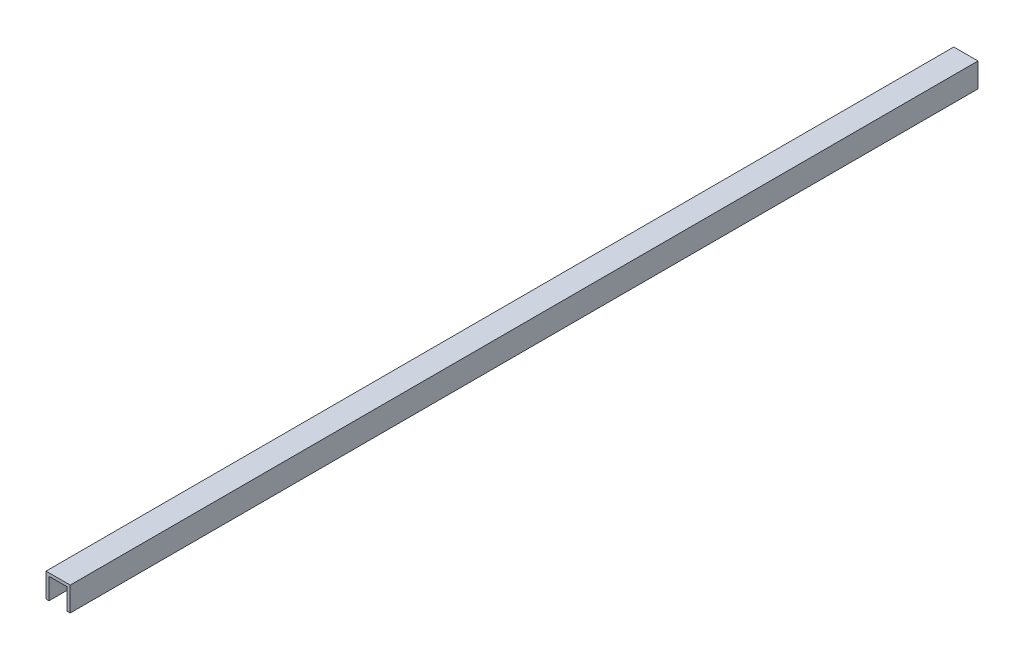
ISO-10303-21;
HEADER;
FILE_DESCRIPTION(('STEP AP214'),'2;1');
FILE_NAME('part.step','',(''),(''),'','','');
FILE_SCHEMA(('AUTOMOTIVE_DESIGN { 1 0 10303 214 1 1 1 1 }'));
ENDSEC;
DATA;
#1=APPLICATION_CONTEXT('core data for automotive mechanical design processes');
#2=APPLICATION_PROTOCOL_DEFINITION('international standard','automotive_design',2000,#1);
#3=PRODUCT_CONTEXT('',#1,'mechanical');
#4=PRODUCT('Part','Part','',(#3));
#5=PRODUCT_RELATED_PRODUCT_CATEGORY('part','',(#4));
#6=PRODUCT_DEFINITION_FORMATION('','',#4);
#7=PRODUCT_DEFINITION_CONTEXT('part definition',#1,'design');
#8=PRODUCT_DEFINITION('design','',#6,#7);
#9=PRODUCT_DEFINITION_SHAPE('','',#8);
#10=(LENGTH_UNIT() NAMED_UNIT(*) SI_UNIT(.MILLI.,.METRE.));
#11=(NAMED_UNIT(*) PLANE_ANGLE_UNIT() SI_UNIT($,.RADIAN.));
#12=(NAMED_UNIT(*) SI_UNIT($,.STERADIAN.) SOLID_ANGLE_UNIT());
#13=UNCERTAINTY_MEASURE_WITH_UNIT(LENGTH_MEASURE(1.E-05),#10,'distance_accuracy_value','');
#14=(GEOMETRIC_REPRESENTATION_CONTEXT(3) GLOBAL_UNCERTAINTY_ASSIGNED_CONTEXT((#13)) GLOBAL_UNIT_ASSIGNED_CONTEXT((#10,
#11,#12)) REPRESENTATION_CONTEXT('',''));
#15=CARTESIAN_POINT('',(0.,0.,0.));
#16=DIRECTION('',(0.,0.,1.));
#17=DIRECTION('',(1.,0.,0.));
#18=AXIS2_PLACEMENT_3D('',#15,#16,#17);
#19=CARTESIAN_POINT('',(4.,-4.,150.));
#20=DIRECTION('',(0.,-1.,0.));
#21=DIRECTION('',(1.,0.,0.));
#22=AXIS2_PLACEMENT_3D('',#19,#20,#21);
#23=PLANE('',#22);
#24=DIRECTION('',(-1.,0.,0.));
#25=VECTOR('',#24,1.);
#26=CARTESIAN_POINT('',(4.,-4.,150.));
#27=LINE('',#26,#25);
#28=CARTESIAN_POINT('',(4.,-4.,150.));
#29=VERTEX_POINT('',#28);
#30=CARTESIAN_POINT('',(3.,-4.,150.));
#31=VERTEX_POINT('',#30);
#32=EDGE_CURVE('E123',#29,#31,#27,.T.);
#33=ORIENTED_EDGE('',*,*,#32,.T.);
#34=DIRECTION('',(0.,0.,-1.));
#35=VECTOR('',#34,1.);
#36=CARTESIAN_POINT('',(3.,-4.,150.));
#37=LINE('',#36,#35);
#38=CARTESIAN_POINT('',(3.,-4.,-150.));
#39=VERTEX_POINT('',#38);
#40=EDGE_CURVE('E112',#31,#39,#37,.T.);
#41=ORIENTED_EDGE('',*,*,#40,.T.);
#42=DIRECTION('',(-1.,0.,0.));
#43=VECTOR('',#42,1.);
#44=CARTESIAN_POINT('',(4.,-4.,-150.));
#45=LINE('',#44,#43);
#46=CARTESIAN_POINT('',(4.,-4.,-150.));
#47=VERTEX_POINT('',#46);
#48=EDGE_CURVE('E121',#47,#39,#45,.T.);
#49=ORIENTED_EDGE('',*,*,#48,.F.);
#50=DIRECTION('',(0.,0.,-1.));
#51=VECTOR('',#50,1.);
#52=CARTESIAN_POINT('',(4.,-4.,150.));
#53=LINE('',#52,#51);
#54=EDGE_CURVE('E59',#29,#47,#53,.T.);
#55=ORIENTED_EDGE('',*,*,#54,.F.);
#56=EDGE_LOOP('',(#33,#41,#49,#55));
#57=FACE_BOUND('',#56,.T.);
#58=ADVANCED_FACE('F35',(#57),#23,.T.);
#59=CARTESIAN_POINT('',(4.,-4.,150.));
#60=DIRECTION('',(-1.,0.,0.));
#61=DIRECTION('',(0.,0.,1.));
#62=AXIS2_PLACEMENT_3D('',#59,#60,#61);
#63=PLANE('',#62);
#64=DIRECTION('',(0.,1.,0.));
#65=VECTOR('',#64,1.);
#66=CARTESIAN_POINT('',(4.,-4.,-150.));
#67=LINE('',#66,#65);
#68=CARTESIAN_POINT('',(4.,4.,-150.));
#69=VERTEX_POINT('',#68);
#70=EDGE_CURVE('E128',#47,#69,#67,.T.);
#71=ORIENTED_EDGE('',*,*,#70,.T.);
#72=DIRECTION('',(0.,0.,-1.));
#73=VECTOR('',#72,1.);
#74=CARTESIAN_POINT('',(4.,4.,150.));
#75=LINE('',#74,#73);
#76=CARTESIAN_POINT('',(4.,4.,150.));
#77=VERTEX_POINT('',#76);
#78=EDGE_CURVE('E11',#77,#69,#75,.T.);
#79=ORIENTED_EDGE('',*,*,#78,.F.);
#80=DIRECTION('',(0.,1.,0.));
#81=VECTOR('',#80,1.);
#82=CARTESIAN_POINT('',(4.,-4.,150.));
#83=LINE('',#82,#81);
#84=EDGE_CURVE('E129',#29,#77,#83,.T.);
#85=ORIENTED_EDGE('',*,*,#84,.F.);
#86=ORIENTED_EDGE('',*,*,#54,.T.);
#87=EDGE_LOOP('',(#71,#79,#85,#86));
#88=FACE_BOUND('',#87,.T.);
#89=ADVANCED_FACE('F37',(#88),#63,.F.);
#90=CARTESIAN_POINT('',(4.,4.,150.));
#91=DIRECTION('',(0.,-1.,0.));
#92=DIRECTION('',(1.,0.,0.));
#93=AXIS2_PLACEMENT_3D('',#90,#91,#92);
#94=PLANE('',#93);
#95=DIRECTION('',(-1.,0.,0.));
#96=VECTOR('',#95,1.);
#97=CARTESIAN_POINT('',(4.,4.,-150.));
#98=LINE('',#97,#96);
#99=CARTESIAN_POINT('',(-4.,4.,-150.));
#100=VERTEX_POINT('',#99);
#101=EDGE_CURVE('E149',#69,#100,#98,.T.);
#102=ORIENTED_EDGE('',*,*,#101,.T.);
#103=DIRECTION('',(0.,0.,-1.));
#104=VECTOR('',#103,1.);
#105=CARTESIAN_POINT('',(-4.,4.,150.));
#106=LINE('',#105,#104);
#107=CARTESIAN_POINT('',(-4.,4.,150.));
#108=VERTEX_POINT('',#107);
#109=EDGE_CURVE('E43',#108,#100,#106,.T.);
#110=ORIENTED_EDGE('',*,*,#109,.F.);
#111=DIRECTION('',(-1.,0.,0.));
#112=VECTOR('',#111,1.);
#113=CARTESIAN_POINT('',(4.,4.,150.));
#114=LINE('',#113,#112);
#115=EDGE_CURVE('E85',#77,#108,#114,.T.);
#116=ORIENTED_EDGE('',*,*,#115,.F.);
#117=ORIENTED_EDGE('',*,*,#78,.T.);
#118=EDGE_LOOP('',(#102,#110,#116,#117));
#119=FACE_BOUND('',#118,.T.);
#120=ADVANCED_FACE('F150',(#119),#94,.F.);
#121=CARTESIAN_POINT('',(-4.,-4.,150.));
#122=DIRECTION('',(-1.,0.,0.));
#123=DIRECTION('',(0.,0.,1.));
#124=AXIS2_PLACEMENT_3D('',#121,#122,#123);
#125=PLANE('',#124);
#126=DIRECTION('',(0.,1.,0.));
#127=VECTOR('',#126,1.);
#128=CARTESIAN_POINT('',(-4.,-4.,-150.));
#129=LINE('',#128,#127);
#130=CARTESIAN_POINT('',(-4.,-4.,-150.));
#131=VERTEX_POINT('',#130);
#132=EDGE_CURVE('E133',#131,#100,#129,.T.);
#133=ORIENTED_EDGE('',*,*,#132,.F.);
#134=DIRECTION('',(0.,0.,-1.));
#135=VECTOR('',#134,1.);
#136=CARTESIAN_POINT('',(-4.,-4.,150.));
#137=LINE('',#136,#135);
#138=CARTESIAN_POINT('',(-4.,-4.,150.));
#139=VERTEX_POINT('',#138);
#140=EDGE_CURVE('E138',#139,#131,#137,.T.);
#141=ORIENTED_EDGE('',*,*,#140,.F.);
#142=DIRECTION('',(0.,1.,0.));
#143=VECTOR('',#142,1.);
#144=CARTESIAN_POINT('',(-4.,-4.,150.));
#145=LINE('',#144,#143);
#146=EDGE_CURVE('E148',#139,#108,#145,.T.);
#147=ORIENTED_EDGE('',*,*,#146,.T.);
#148=ORIENTED_EDGE('',*,*,#109,.T.);
#149=EDGE_LOOP('',(#133,#141,#147,#148));
#150=FACE_BOUND('',#149,.T.);
#151=ADVANCED_FACE('F144',(#150),#125,.T.);
#152=DIRECTION('',(0.,0.,-1.));
#153=VECTOR('',#152,1.);
#154=CARTESIAN_POINT('',(-3.,-4.,150.));
#155=LINE('',#154,#153);
#156=CARTESIAN_POINT('',(-3.,-4.,150.));
#157=VERTEX_POINT('',#156);
#158=CARTESIAN_POINT('',(-3.,-4.,-150.));
#159=VERTEX_POINT('',#158);
#160=EDGE_CURVE('E124',#157,#159,#155,.T.);
#161=ORIENTED_EDGE('',*,*,#160,.F.);
#162=EDGE_CURVE('E157',#157,#139,#27,.T.);
#163=ORIENTED_EDGE('',*,*,#162,.T.);
#164=ORIENTED_EDGE('',*,*,#140,.T.);
#165=EDGE_CURVE('E130',#159,#131,#45,.T.);
#166=ORIENTED_EDGE('',*,*,#165,.F.);
#167=EDGE_LOOP('',(#161,#163,#164,#166));
#168=FACE_BOUND('',#167,.T.);
#169=ADVANCED_FACE('F155',(#168),#23,.T.);
#170=CARTESIAN_POINT('',(0.,0.,150.));
#171=DIRECTION('',(0.,0.,1.));
#172=DIRECTION('',(1.,0.,0.));
#173=AXIS2_PLACEMENT_3D('',#170,#171,#172);
#174=PLANE('',#173);
#175=DIRECTION('',(0.,1.,0.));
#176=VECTOR('',#175,1.);
#177=CARTESIAN_POINT('',(3.,-4.,150.));
#178=LINE('',#177,#176);
#179=CARTESIAN_POINT('',(3.,3.,150.));
#180=VERTEX_POINT('',#179);
#181=EDGE_CURVE('E169',#31,#180,#178,.T.);
#182=ORIENTED_EDGE('',*,*,#181,.F.);
#183=ORIENTED_EDGE('',*,*,#32,.F.);
#184=ORIENTED_EDGE('',*,*,#84,.T.);
#185=ORIENTED_EDGE('',*,*,#115,.T.);
#186=ORIENTED_EDGE('',*,*,#146,.F.);
#187=ORIENTED_EDGE('',*,*,#162,.F.);
#188=DIRECTION('',(0.,1.,0.));
#189=VECTOR('',#188,1.);
#190=CARTESIAN_POINT('',(-3.,-4.,150.));
#191=LINE('',#190,#189);
#192=CARTESIAN_POINT('',(-3.,3.,150.));
#193=VERTEX_POINT('',#192);
#194=EDGE_CURVE('E125',#157,#193,#191,.T.);
#195=ORIENTED_EDGE('',*,*,#194,.T.);
#196=DIRECTION('',(-1.,0.,0.));
#197=VECTOR('',#196,1.);
#198=CARTESIAN_POINT('',(4.,3.,150.));
#199=LINE('',#198,#197);
#200=EDGE_CURVE('E171',#180,#193,#199,.T.);
#201=ORIENTED_EDGE('',*,*,#200,.F.);
#202=EDGE_LOOP('',(#182,#183,#184,#185,#186,#187,#195,#201));
#203=FACE_BOUND('',#202,.T.);
#204=ADVANCED_FACE('F159',(#203),#174,.T.);
#205=CARTESIAN_POINT('',(0.,0.,-150.));
#206=DIRECTION('',(0.,0.,1.));
#207=DIRECTION('',(1.,0.,0.));
#208=AXIS2_PLACEMENT_3D('',#205,#206,#207);
#209=PLANE('',#208);
#210=ORIENTED_EDGE('',*,*,#48,.T.);
#211=DIRECTION('',(0.,1.,0.));
#212=VECTOR('',#211,1.);
#213=CARTESIAN_POINT('',(3.,-4.,-150.));
#214=LINE('',#213,#212);
#215=CARTESIAN_POINT('',(3.,3.,-150.));
#216=VERTEX_POINT('',#215);
#217=EDGE_CURVE('E109',#39,#216,#214,.T.);
#218=ORIENTED_EDGE('',*,*,#217,.T.);
#219=DIRECTION('',(-1.,0.,0.));
#220=VECTOR('',#219,1.);
#221=CARTESIAN_POINT('',(4.,3.,-150.));
#222=LINE('',#221,#220);
#223=CARTESIAN_POINT('',(-3.,3.,-150.));
#224=VERTEX_POINT('',#223);
#225=EDGE_CURVE('E119',#216,#224,#222,.T.);
#226=ORIENTED_EDGE('',*,*,#225,.T.);
#227=DIRECTION('',(0.,1.,0.));
#228=VECTOR('',#227,1.);
#229=CARTESIAN_POINT('',(-3.,-4.,-150.));
#230=LINE('',#229,#228);
#231=EDGE_CURVE('E50',#159,#224,#230,.T.);
#232=ORIENTED_EDGE('',*,*,#231,.F.);
#233=ORIENTED_EDGE('',*,*,#165,.T.);
#234=ORIENTED_EDGE('',*,*,#132,.T.);
#235=ORIENTED_EDGE('',*,*,#101,.F.);
#236=ORIENTED_EDGE('',*,*,#70,.F.);
#237=EDGE_LOOP('',(#210,#218,#226,#232,#233,#234,#235,#236));
#238=FACE_BOUND('',#237,.T.);
#239=ADVANCED_FACE('F127',(#238),#209,.F.);
#240=CARTESIAN_POINT('',(3.,-4.,150.));
#241=DIRECTION('',(-1.,0.,0.));
#242=DIRECTION('',(0.,0.,1.));
#243=AXIS2_PLACEMENT_3D('',#240,#241,#242);
#244=PLANE('',#243);
#245=ORIENTED_EDGE('',*,*,#217,.F.);
#246=ORIENTED_EDGE('',*,*,#40,.F.);
#247=ORIENTED_EDGE('',*,*,#181,.T.);
#248=DIRECTION('',(0.,0.,-1.));
#249=VECTOR('',#248,1.);
#250=CARTESIAN_POINT('',(3.,3.,150.));
#251=LINE('',#250,#249);
#252=EDGE_CURVE('E115',#180,#216,#251,.T.);
#253=ORIENTED_EDGE('',*,*,#252,.T.);
#254=EDGE_LOOP('',(#245,#246,#247,#253));
#255=FACE_BOUND('',#254,.T.);
#256=ADVANCED_FACE('F111',(#255),#244,.T.);
#257=CARTESIAN_POINT('',(4.,3.,150.));
#258=DIRECTION('',(0.,-1.,0.));
#259=DIRECTION('',(1.,0.,0.));
#260=AXIS2_PLACEMENT_3D('',#257,#258,#259);
#261=PLANE('',#260);
#262=ORIENTED_EDGE('',*,*,#225,.F.);
#263=ORIENTED_EDGE('',*,*,#252,.F.);
#264=ORIENTED_EDGE('',*,*,#200,.T.);
#265=DIRECTION('',(0.,0.,-1.));
#266=VECTOR('',#265,1.);
#267=CARTESIAN_POINT('',(-3.,3.,150.));
#268=LINE('',#267,#266);
#269=EDGE_CURVE('E165',#193,#224,#268,.T.);
#270=ORIENTED_EDGE('',*,*,#269,.T.);
#271=EDGE_LOOP('',(#262,#263,#264,#270));
#272=FACE_BOUND('',#271,.T.);
#273=ADVANCED_FACE('F177',(#272),#261,.T.);
#274=CARTESIAN_POINT('',(-3.,-4.,150.));
#275=DIRECTION('',(-1.,0.,0.));
#276=DIRECTION('',(0.,0.,1.));
#277=AXIS2_PLACEMENT_3D('',#274,#275,#276);
#278=PLANE('',#277);
#279=ORIENTED_EDGE('',*,*,#231,.T.);
#280=ORIENTED_EDGE('',*,*,#269,.F.);
#281=ORIENTED_EDGE('',*,*,#194,.F.);
#282=ORIENTED_EDGE('',*,*,#160,.T.);
#283=EDGE_LOOP('',(#279,#280,#281,#282));
#284=FACE_BOUND('',#283,.T.);
#285=ADVANCED_FACE('F179',(#284),#278,.F.);
#286=CLOSED_SHELL('',(#58,#89,#120,#151,#169,#204,#239,#256,#273,#285));
#287=MANIFOLD_SOLID_BREP('B2',#286);
#288=ADVANCED_BREP_SHAPE_REPRESENTATION('',(#18,#287),#14);
#289=SHAPE_DEFINITION_REPRESENTATION(#9,#288);
ENDSEC;
END-ISO-10303-21;
